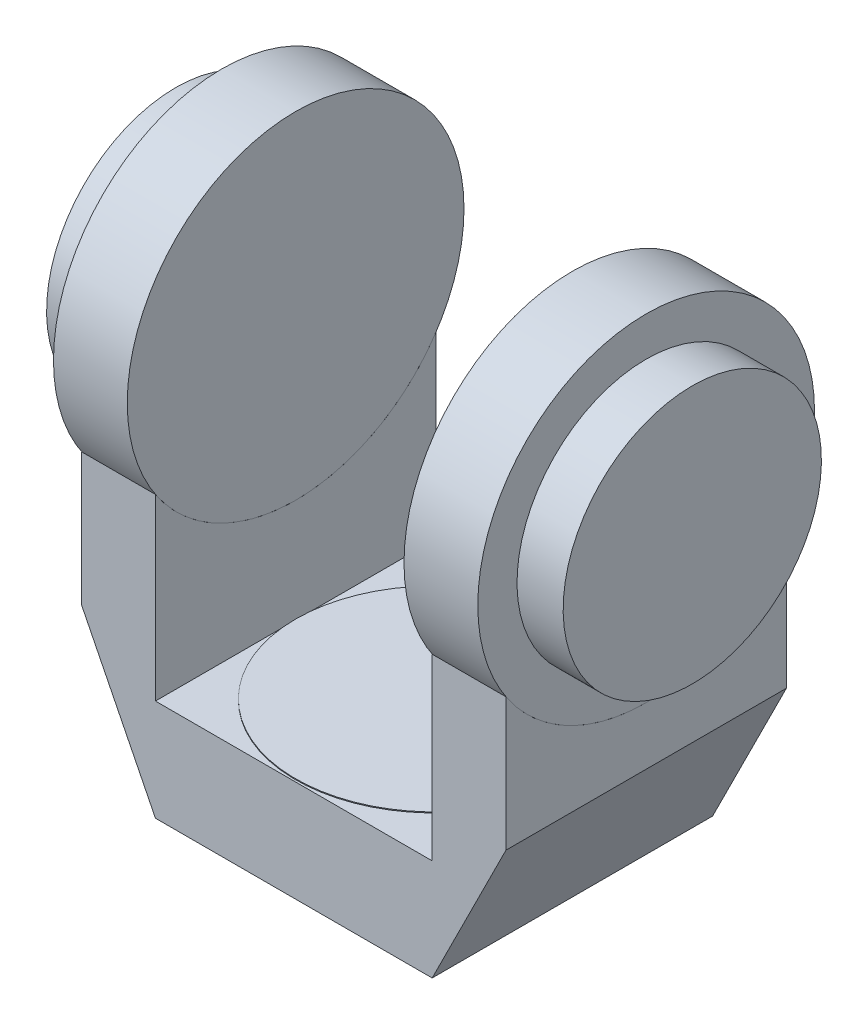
ISO-10303-21;
HEADER;
FILE_DESCRIPTION(('STEP AP214'),'2;1');
FILE_NAME('part.step','',(''),(''),'','','');
FILE_SCHEMA(('AUTOMOTIVE_DESIGN { 1 0 10303 214 1 1 1 1 }'));
ENDSEC;
DATA;
#1=APPLICATION_CONTEXT('core data for automotive mechanical design processes');
#2=APPLICATION_PROTOCOL_DEFINITION('international standard','automotive_design',2000,#1);
#3=PRODUCT_CONTEXT('',#1,'mechanical');
#4=PRODUCT('Part','Part','',(#3));
#5=PRODUCT_RELATED_PRODUCT_CATEGORY('part','',(#4));
#6=PRODUCT_DEFINITION_FORMATION('','',#4);
#7=PRODUCT_DEFINITION_CONTEXT('part definition',#1,'design');
#8=PRODUCT_DEFINITION('design','',#6,#7);
#9=PRODUCT_DEFINITION_SHAPE('','',#8);
#10=(LENGTH_UNIT() NAMED_UNIT(*) SI_UNIT(.MILLI.,.METRE.));
#11=(NAMED_UNIT(*) PLANE_ANGLE_UNIT() SI_UNIT($,.RADIAN.));
#12=(NAMED_UNIT(*) SI_UNIT($,.STERADIAN.) SOLID_ANGLE_UNIT());
#13=UNCERTAINTY_MEASURE_WITH_UNIT(LENGTH_MEASURE(1.E-05),#10,'distance_accuracy_value','');
#14=(GEOMETRIC_REPRESENTATION_CONTEXT(3) GLOBAL_UNCERTAINTY_ASSIGNED_CONTEXT((#13)) GLOBAL_UNIT_ASSIGNED_CONTEXT((#10,
#11,#12)) REPRESENTATION_CONTEXT('',''));
#15=CARTESIAN_POINT('',(0.,0.,0.));
#16=DIRECTION('',(0.,0.,1.));
#17=DIRECTION('',(1.,0.,0.));
#18=AXIS2_PLACEMENT_3D('',#15,#16,#17);
#19=CARTESIAN_POINT('',(0.,55.5,0.));
#20=DIRECTION('',(0.,-1.,0.));
#21=DIRECTION('',(1.,0.,0.));
#22=AXIS2_PLACEMENT_3D('',#19,#20,#21);
#23=CYLINDRICAL_SURFACE('',#22,75.);
#24=CARTESIAN_POINT('',(0.,55.5,0.));
#25=DIRECTION('',(0.,1.,0.));
#26=DIRECTION('',(-1.,0.,0.));
#27=AXIS2_PLACEMENT_3D('',#24,#25,#26);
#28=CIRCLE('',#27,75.);
#29=CARTESIAN_POINT('',(-75.,55.5,0.));
#30=VERTEX_POINT('',#29);
#31=EDGE_CURVE('E11',#30,#30,#28,.T.);
#32=ORIENTED_EDGE('',*,*,#31,.F.);
#33=EDGE_LOOP('',(#32));
#34=FACE_BOUND('',#33,.T.);
#35=CARTESIAN_POINT('',(0.,55.,0.));
#36=DIRECTION('',(0.,1.,0.));
#37=DIRECTION('',(-1.,0.,0.));
#38=AXIS2_PLACEMENT_3D('',#35,#36,#37);
#39=CIRCLE('',#38,75.);
#40=CARTESIAN_POINT('',(-75.,55.,0.));
#41=VERTEX_POINT('',#40);
#42=EDGE_CURVE('E52',#41,#41,#39,.T.);
#43=ORIENTED_EDGE('',*,*,#42,.T.);
#44=EDGE_LOOP('',(#43));
#45=FACE_BOUND('',#44,.T.);
#46=ADVANCED_FACE('F49',(#34,#45),#23,.T.);
#47=CARTESIAN_POINT('',(0.,55.5,0.));
#48=DIRECTION('',(0.,1.,0.));
#49=DIRECTION('',(-1.,0.,0.));
#50=AXIS2_PLACEMENT_3D('',#47,#48,#49);
#51=PLANE('',#50);
#52=ORIENTED_EDGE('',*,*,#31,.T.);
#53=EDGE_LOOP('',(#52));
#54=FACE_BOUND('',#53,.T.);
#55=ADVANCED_FACE('F66',(#54),#51,.T.);
#56=CARTESIAN_POINT('',(0.,55.,0.));
#57=DIRECTION('',(0.,1.,0.));
#58=DIRECTION('',(-1.,0.,0.));
#59=AXIS2_PLACEMENT_3D('',#56,#57,#58);
#60=PLANE('',#59);
#61=ORIENTED_EDGE('',*,*,#42,.F.);
#62=EDGE_LOOP('',(#61));
#63=FACE_BOUND('',#62,.T.);
#64=ADVANCED_FACE('F64',(#63),#60,.F.);
#65=CLOSED_SHELL('',(#46,#55,#64));
#66=MANIFOLD_SOLID_BREP('B2',#65);
#67=CARTESIAN_POINT('',(-373.122259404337,202.513155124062,0.00443107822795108));
#68=DIRECTION('',(1.,0.,0.));
#69=DIRECTION('',(0.,0.,1.));
#70=AXIS2_PLACEMENT_3D('',#67,#68,#69);
#71=CYLINDRICAL_SURFACE('',#70,91.26);
#72=CARTESIAN_POINT('',(-115.,202.513155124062,0.00443107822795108));
#73=DIRECTION('',(-1.,0.,0.));
#74=DIRECTION('',(0.,-1.,0.));
#75=AXIS2_PLACEMENT_3D('',#72,#73,#74);
#76=CIRCLE('',#75,91.26);
#77=CARTESIAN_POINT('',(-115.,111.253155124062,0.00443107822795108));
#78=VERTEX_POINT('',#77);
#79=EDGE_CURVE('E48',#78,#78,#76,.F.);
#80=ORIENTED_EDGE('',*,*,#79,.T.);
#81=EDGE_LOOP('',(#80));
#82=FACE_BOUND('',#81,.T.);
#83=CARTESIAN_POINT('',(-75.,202.513155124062,0.00443107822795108));
#84=DIRECTION('',(-1.,0.,0.));
#85=DIRECTION('',(0.,0.,1.));
#86=AXIS2_PLACEMENT_3D('',#83,#84,#85);
#87=CIRCLE('',#86,91.26);
#88=CARTESIAN_POINT('',(-75.,202.513155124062,91.264431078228));
#89=VERTEX_POINT('',#88);
#90=EDGE_CURVE('E109',#89,#89,#87,.T.);
#91=ORIENTED_EDGE('',*,*,#90,.T.);
#92=EDGE_LOOP('',(#91));
#93=FACE_BOUND('',#92,.T.);
#94=ADVANCED_FACE('F102',(#82,#93),#71,.T.);
#95=CARTESIAN_POINT('',(-75.,202.513155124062,0.00443107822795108));
#96=DIRECTION('',(1.,0.,0.));
#97=DIRECTION('',(0.,0.,1.));
#98=AXIS2_PLACEMENT_3D('',#95,#96,#97);
#99=PLANE('',#98);
#100=ORIENTED_EDGE('',*,*,#90,.F.);
#101=EDGE_LOOP('',(#100));
#102=FACE_BOUND('',#101,.T.);
#103=ADVANCED_FACE('F117',(#102),#99,.T.);
#104=CARTESIAN_POINT('',(-115.,80.,76.));
#105=DIRECTION('',(1.,0.,0.));
#106=DIRECTION('',(0.,-1.,0.));
#107=AXIS2_PLACEMENT_3D('',#104,#105,#106);
#108=PLANE('',#107);
#109=ORIENTED_EDGE('',*,*,#79,.F.);
#110=EDGE_LOOP('',(#109));
#111=FACE_BOUND('',#110,.T.);
#112=ADVANCED_FACE('F119',(#111),#108,.F.);
#113=CLOSED_SHELL('',(#94,#103,#112));
#114=MANIFOLD_SOLID_BREP('B6',#113);
#115=CARTESIAN_POINT('',(-140.,202.513155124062,0.00443107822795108));
#116=DIRECTION('',(1.,0.,0.));
#117=DIRECTION('',(0.,-1.,0.));
#118=AXIS2_PLACEMENT_3D('',#115,#116,#117);
#119=CYLINDRICAL_SURFACE('',#118,70.);
#120=CARTESIAN_POINT('',(-140.,202.513155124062,0.00443107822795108));
#121=DIRECTION('',(1.,0.,0.));
#122=DIRECTION('',(0.,1.,0.));
#123=AXIS2_PLACEMENT_3D('',#120,#121,#122);
#124=CIRCLE('',#123,70.);
#125=CARTESIAN_POINT('',(-140.,272.513155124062,0.00443107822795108));
#126=VERTEX_POINT('',#125);
#127=EDGE_CURVE('E101',#126,#126,#124,.T.);
#128=ORIENTED_EDGE('',*,*,#127,.T.);
#129=EDGE_LOOP('',(#128));
#130=FACE_BOUND('',#129,.T.);
#131=CARTESIAN_POINT('',(-115.,202.513155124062,0.00443107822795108));
#132=DIRECTION('',(1.,0.,0.));
#133=DIRECTION('',(0.,1.,0.));
#134=AXIS2_PLACEMENT_3D('',#131,#132,#133);
#135=CIRCLE('',#134,70.);
#136=CARTESIAN_POINT('',(-115.,272.513155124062,0.00443107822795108));
#137=VERTEX_POINT('',#136);
#138=EDGE_CURVE('E158',#137,#137,#135,.T.);
#139=ORIENTED_EDGE('',*,*,#138,.F.);
#140=EDGE_LOOP('',(#139));
#141=FACE_BOUND('',#140,.T.);
#142=ADVANCED_FACE('F155',(#130,#141),#119,.T.);
#143=CARTESIAN_POINT('',(-140.,202.513155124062,0.00443107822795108));
#144=DIRECTION('',(-1.,0.,0.));
#145=DIRECTION('',(0.,1.,0.));
#146=AXIS2_PLACEMENT_3D('',#143,#144,#145);
#147=PLANE('',#146);
#148=ORIENTED_EDGE('',*,*,#127,.F.);
#149=EDGE_LOOP('',(#148));
#150=FACE_BOUND('',#149,.T.);
#151=ADVANCED_FACE('F172',(#150),#147,.T.);
#152=CARTESIAN_POINT('',(-115.,202.513155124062,0.00443107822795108));
#153=DIRECTION('',(-1.,0.,0.));
#154=DIRECTION('',(0.,1.,0.));
#155=AXIS2_PLACEMENT_3D('',#152,#153,#154);
#156=PLANE('',#155);
#157=ORIENTED_EDGE('',*,*,#138,.T.);
#158=EDGE_LOOP('',(#157));
#159=FACE_BOUND('',#158,.T.);
#160=ADVANCED_FACE('F169',(#159),#156,.F.);
#161=CLOSED_SHELL('',(#142,#151,#160));
#162=MANIFOLD_SOLID_BREP('B43',#161);
#163=CARTESIAN_POINT('',(140.,202.513155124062,0.00443107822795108));
#164=DIRECTION('',(-1.,0.,0.));
#165=DIRECTION('',(0.,-1.,0.));
#166=AXIS2_PLACEMENT_3D('',#163,#164,#165);
#167=CYLINDRICAL_SURFACE('',#166,70.);
#168=CARTESIAN_POINT('',(140.,202.513155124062,0.00443107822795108));
#169=DIRECTION('',(1.,0.,0.));
#170=DIRECTION('',(0.,1.,0.));
#171=AXIS2_PLACEMENT_3D('',#168,#169,#170);
#172=CIRCLE('',#171,70.);
#173=CARTESIAN_POINT('',(140.,272.513155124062,0.00443107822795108));
#174=VERTEX_POINT('',#173);
#175=EDGE_CURVE('E154',#174,#174,#172,.T.);
#176=ORIENTED_EDGE('',*,*,#175,.F.);
#177=EDGE_LOOP('',(#176));
#178=FACE_BOUND('',#177,.T.);
#179=CARTESIAN_POINT('',(115.,202.513155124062,0.00443107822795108));
#180=DIRECTION('',(1.,0.,0.));
#181=DIRECTION('',(0.,1.,0.));
#182=AXIS2_PLACEMENT_3D('',#179,#180,#181);
#183=CIRCLE('',#182,70.);
#184=CARTESIAN_POINT('',(115.,272.513155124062,0.00443107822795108));
#185=VERTEX_POINT('',#184);
#186=EDGE_CURVE('E211',#185,#185,#183,.T.);
#187=ORIENTED_EDGE('',*,*,#186,.T.);
#188=EDGE_LOOP('',(#187));
#189=FACE_BOUND('',#188,.T.);
#190=ADVANCED_FACE('F208',(#178,#189),#167,.T.);
#191=CARTESIAN_POINT('',(140.,202.513155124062,0.00443107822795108));
#192=DIRECTION('',(1.,0.,0.));
#193=DIRECTION('',(0.,1.,0.));
#194=AXIS2_PLACEMENT_3D('',#191,#192,#193);
#195=PLANE('',#194);
#196=ORIENTED_EDGE('',*,*,#175,.T.);
#197=EDGE_LOOP('',(#196));
#198=FACE_BOUND('',#197,.T.);
#199=ADVANCED_FACE('F225',(#198),#195,.T.);
#200=CARTESIAN_POINT('',(115.,202.513155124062,0.00443107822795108));
#201=DIRECTION('',(1.,0.,0.));
#202=DIRECTION('',(0.,1.,0.));
#203=AXIS2_PLACEMENT_3D('',#200,#201,#202);
#204=PLANE('',#203);
#205=ORIENTED_EDGE('',*,*,#186,.F.);
#206=EDGE_LOOP('',(#205));
#207=FACE_BOUND('',#206,.T.);
#208=ADVANCED_FACE('F223',(#207),#204,.F.);
#209=CLOSED_SHELL('',(#190,#199,#208));
#210=MANIFOLD_SOLID_BREP('B96',#209);
#211=CARTESIAN_POINT('',(373.122259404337,202.513155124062,0.00443107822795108));
#212=DIRECTION('',(-1.,0.,0.));
#213=DIRECTION('',(0.,0.,1.));
#214=AXIS2_PLACEMENT_3D('',#211,#212,#213);
#215=CYLINDRICAL_SURFACE('',#214,91.26);
#216=CARTESIAN_POINT('',(115.,202.513155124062,0.00443107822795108));
#217=DIRECTION('',(-1.,0.,0.));
#218=DIRECTION('',(0.,-1.,0.));
#219=AXIS2_PLACEMENT_3D('',#216,#217,#218);
#220=CIRCLE('',#219,91.26);
#221=CARTESIAN_POINT('',(115.,111.253155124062,0.00443107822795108));
#222=VERTEX_POINT('',#221);
#223=EDGE_CURVE('E207',#222,#222,#220,.F.);
#224=ORIENTED_EDGE('',*,*,#223,.F.);
#225=EDGE_LOOP('',(#224));
#226=FACE_BOUND('',#225,.T.);
#227=CARTESIAN_POINT('',(75.,202.513155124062,0.00443107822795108));
#228=DIRECTION('',(-1.,0.,0.));
#229=DIRECTION('',(0.,0.,1.));
#230=AXIS2_PLACEMENT_3D('',#227,#228,#229);
#231=CIRCLE('',#230,91.26);
#232=CARTESIAN_POINT('',(75.,202.513155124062,91.264431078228));
#233=VERTEX_POINT('',#232);
#234=EDGE_CURVE('E269',#233,#233,#231,.T.);
#235=ORIENTED_EDGE('',*,*,#234,.F.);
#236=EDGE_LOOP('',(#235));
#237=FACE_BOUND('',#236,.T.);
#238=ADVANCED_FACE('F262',(#226,#237),#215,.T.);
#239=CARTESIAN_POINT('',(75.,202.513155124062,0.00443107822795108));
#240=DIRECTION('',(-1.,0.,0.));
#241=DIRECTION('',(0.,0.,1.));
#242=AXIS2_PLACEMENT_3D('',#239,#240,#241);
#243=PLANE('',#242);
#244=ORIENTED_EDGE('',*,*,#234,.T.);
#245=EDGE_LOOP('',(#244));
#246=FACE_BOUND('',#245,.T.);
#247=ADVANCED_FACE('F276',(#246),#243,.T.);
#248=CARTESIAN_POINT('',(115.,80.,76.));
#249=DIRECTION('',(-1.,0.,0.));
#250=DIRECTION('',(0.,-1.,0.));
#251=AXIS2_PLACEMENT_3D('',#248,#249,#250);
#252=PLANE('',#251);
#253=ORIENTED_EDGE('',*,*,#223,.T.);
#254=EDGE_LOOP('',(#253));
#255=FACE_BOUND('',#254,.T.);
#256=ADVANCED_FACE('F283',(#255),#252,.F.);
#257=CLOSED_SHELL('',(#238,#247,#256));
#258=MANIFOLD_SOLID_BREP('B149',#257);
#259=CARTESIAN_POINT('',(-75.,0.,76.));
#260=DIRECTION('',(0.894427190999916,0.447213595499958,0.));
#261=DIRECTION('',(-0.447213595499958,0.894427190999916,0.));
#262=AXIS2_PLACEMENT_3D('',#259,#260,#261);
#263=PLANE('',#262);
#264=DIRECTION('',(0.447213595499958,-0.894427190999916,0.));
#265=VECTOR('',#264,1.);
#266=CARTESIAN_POINT('',(-75.,0.,-76.));
#267=LINE('',#266,#265);
#268=CARTESIAN_POINT('',(-115.,80.,-76.));
#269=VERTEX_POINT('',#268);
#270=CARTESIAN_POINT('',(-75.,0.,-76.));
#271=VERTEX_POINT('',#270);
#272=EDGE_CURVE('E423',#269,#271,#267,.T.);
#273=ORIENTED_EDGE('',*,*,#272,.T.);
#274=DIRECTION('',(0.,0.,-1.));
#275=VECTOR('',#274,1.);
#276=CARTESIAN_POINT('',(-75.,0.,76.));
#277=LINE('',#276,#275);
#278=CARTESIAN_POINT('',(-75.,0.,76.));
#279=VERTEX_POINT('',#278);
#280=EDGE_CURVE('E260',#279,#271,#277,.T.);
#281=ORIENTED_EDGE('',*,*,#280,.F.);
#282=DIRECTION('',(0.447213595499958,-0.894427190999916,0.));
#283=VECTOR('',#282,1.);
#284=CARTESIAN_POINT('',(-75.,0.,76.));
#285=LINE('',#284,#283);
#286=CARTESIAN_POINT('',(-115.,80.,76.));
#287=VERTEX_POINT('',#286);
#288=EDGE_CURVE('E455',#287,#279,#285,.T.);
#289=ORIENTED_EDGE('',*,*,#288,.F.);
#290=DIRECTION('',(0.,0.,-1.));
#291=VECTOR('',#290,1.);
#292=CARTESIAN_POINT('',(-115.,80.,76.));
#293=LINE('',#292,#291);
#294=EDGE_CURVE('E422',#287,#269,#293,.T.);
#295=ORIENTED_EDGE('',*,*,#294,.T.);
#296=EDGE_LOOP('',(#273,#281,#289,#295));
#297=FACE_BOUND('',#296,.T.);
#298=ADVANCED_FACE('F307',(#297),#263,.F.);
#299=CARTESIAN_POINT('',(75.,0.,76.));
#300=DIRECTION('',(0.,1.,0.));
#301=DIRECTION('',(-1.,0.,0.));
#302=AXIS2_PLACEMENT_3D('',#299,#300,#301);
#303=PLANE('',#302);
#304=DIRECTION('',(1.,0.,0.));
#305=VECTOR('',#304,1.);
#306=CARTESIAN_POINT('',(75.,0.,-76.));
#307=LINE('',#306,#305);
#308=CARTESIAN_POINT('',(75.,0.,-76.));
#309=VERTEX_POINT('',#308);
#310=EDGE_CURVE('E427',#271,#309,#307,.T.);
#311=ORIENTED_EDGE('',*,*,#310,.T.);
#312=DIRECTION('',(0.,0.,-1.));
#313=VECTOR('',#312,1.);
#314=CARTESIAN_POINT('',(75.,0.,76.));
#315=LINE('',#314,#313);
#316=CARTESIAN_POINT('',(75.,0.,76.));
#317=VERTEX_POINT('',#316);
#318=EDGE_CURVE('E316',#317,#309,#315,.T.);
#319=ORIENTED_EDGE('',*,*,#318,.F.);
#320=DIRECTION('',(1.,0.,0.));
#321=VECTOR('',#320,1.);
#322=CARTESIAN_POINT('',(75.,0.,76.));
#323=LINE('',#322,#321);
#324=EDGE_CURVE('E370',#279,#317,#323,.T.);
#325=ORIENTED_EDGE('',*,*,#324,.F.);
#326=ORIENTED_EDGE('',*,*,#280,.T.);
#327=EDGE_LOOP('',(#311,#319,#325,#326));
#328=FACE_BOUND('',#327,.T.);
#329=ADVANCED_FACE('F510',(#328),#303,.F.);
#330=CARTESIAN_POINT('',(75.,0.,76.));
#331=DIRECTION('',(-0.894427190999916,0.447213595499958,0.));
#332=DIRECTION('',(-0.447213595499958,-0.894427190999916,0.));
#333=AXIS2_PLACEMENT_3D('',#330,#331,#332);
#334=PLANE('',#333);
#335=DIRECTION('',(0.447213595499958,0.894427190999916,0.));
#336=VECTOR('',#335,1.);
#337=CARTESIAN_POINT('',(75.,0.,-76.));
#338=LINE('',#337,#336);
#339=CARTESIAN_POINT('',(115.,80.,-76.));
#340=VERTEX_POINT('',#339);
#341=EDGE_CURVE('E431',#309,#340,#338,.T.);
#342=ORIENTED_EDGE('',*,*,#341,.T.);
#343=DIRECTION('',(0.,0.,-1.));
#344=VECTOR('',#343,1.);
#345=CARTESIAN_POINT('',(115.,80.,76.));
#346=LINE('',#345,#344);
#347=CARTESIAN_POINT('',(115.,80.,76.));
#348=VERTEX_POINT('',#347);
#349=EDGE_CURVE('E403',#348,#340,#346,.T.);
#350=ORIENTED_EDGE('',*,*,#349,.F.);
#351=DIRECTION('',(0.447213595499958,0.894427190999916,0.));
#352=VECTOR('',#351,1.);
#353=CARTESIAN_POINT('',(75.,0.,76.));
#354=LINE('',#353,#352);
#355=EDGE_CURVE('E471',#317,#348,#354,.T.);
#356=ORIENTED_EDGE('',*,*,#355,.F.);
#357=ORIENTED_EDGE('',*,*,#318,.T.);
#358=EDGE_LOOP('',(#342,#350,#356,#357));
#359=FACE_BOUND('',#358,.T.);
#360=ADVANCED_FACE('F469',(#359),#334,.F.);
#361=CARTESIAN_POINT('',(115.,80.,76.));
#362=DIRECTION('',(-1.,0.,0.));
#363=DIRECTION('',(0.,-1.,0.));
#364=AXIS2_PLACEMENT_3D('',#361,#362,#363);
#365=PLANE('',#364);
#366=DIRECTION('',(0.,1.,0.));
#367=VECTOR('',#366,1.);
#368=CARTESIAN_POINT('',(115.,80.,-76.));
#369=LINE('',#368,#367);
#370=CARTESIAN_POINT('',(115.,152.,-76.));
#371=VERTEX_POINT('',#370);
#372=EDGE_CURVE('E434',#340,#371,#369,.T.);
#373=ORIENTED_EDGE('',*,*,#372,.T.);
#374=CARTESIAN_POINT('',(115.,202.513155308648,0.));
#375=DIRECTION('',(1.,0.,0.));
#376=DIRECTION('',(0.,1.,0.));
#377=AXIS2_PLACEMENT_3D('',#374,#375,#376);
#378=CIRCLE('',#377,91.2555689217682);
#379=CARTESIAN_POINT('',(115.,152.,76.));
#380=VERTEX_POINT('',#379);
#381=EDGE_CURVE('E482',#380,#371,#378,.T.);
#382=ORIENTED_EDGE('',*,*,#381,.F.);
#383=DIRECTION('',(0.,1.,0.));
#384=VECTOR('',#383,1.);
#385=CARTESIAN_POINT('',(115.,80.,76.));
#386=LINE('',#385,#384);
#387=EDGE_CURVE('E483',#348,#380,#386,.T.);
#388=ORIENTED_EDGE('',*,*,#387,.F.);
#389=ORIENTED_EDGE('',*,*,#349,.T.);
#390=EDGE_LOOP('',(#373,#382,#388,#389));
#391=FACE_BOUND('',#390,.T.);
#392=ADVANCED_FACE('F479',(#391),#365,.F.);
#393=CARTESIAN_POINT('',(75.,152.,76.));
#394=DIRECTION('',(1.,0.,0.));
#395=DIRECTION('',(0.,0.,-1.));
#396=AXIS2_PLACEMENT_3D('',#393,#394,#395);
#397=PLANE('',#396);
#398=DIRECTION('',(0.,-1.,0.));
#399=VECTOR('',#398,1.);
#400=CARTESIAN_POINT('',(75.,152.,76.));
#401=LINE('',#400,#399);
#402=CARTESIAN_POINT('',(74.9999999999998,152.,76.));
#403=VERTEX_POINT('',#402);
#404=CARTESIAN_POINT('',(75.,55.,76.));
#405=VERTEX_POINT('',#404);
#406=EDGE_CURVE('E380',#403,#405,#401,.T.);
#407=ORIENTED_EDGE('',*,*,#406,.F.);
#408=CARTESIAN_POINT('',(75.,202.513155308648,0.));
#409=DIRECTION('',(1.,0.,0.));
#410=DIRECTION('',(0.,0.,-1.));
#411=AXIS2_PLACEMENT_3D('',#408,#409,#410);
#412=CIRCLE('',#411,91.2555689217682);
#413=CARTESIAN_POINT('',(74.9999999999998,152.,-76.));
#414=VERTEX_POINT('',#413);
#415=EDGE_CURVE('E428',#403,#414,#412,.T.);
#416=ORIENTED_EDGE('',*,*,#415,.T.);
#417=DIRECTION('',(0.,-1.,0.));
#418=VECTOR('',#417,1.);
#419=CARTESIAN_POINT('',(75.,152.,-76.));
#420=LINE('',#419,#418);
#421=CARTESIAN_POINT('',(75.,55.,-76.));
#422=VERTEX_POINT('',#421);
#423=EDGE_CURVE('E399',#414,#422,#420,.T.);
#424=ORIENTED_EDGE('',*,*,#423,.T.);
#425=DIRECTION('',(0.,0.,-1.));
#426=VECTOR('',#425,1.);
#427=CARTESIAN_POINT('',(75.,55.,76.));
#428=LINE('',#427,#426);
#429=EDGE_CURVE('E396',#405,#422,#428,.T.);
#430=ORIENTED_EDGE('',*,*,#429,.F.);
#431=EDGE_LOOP('',(#407,#416,#424,#430));
#432=FACE_BOUND('',#431,.T.);
#433=ADVANCED_FACE('F397',(#432),#397,.F.);
#434=CARTESIAN_POINT('',(-75.,55.,76.));
#435=DIRECTION('',(0.,-1.,0.));
#436=DIRECTION('',(1.,0.,0.));
#437=AXIS2_PLACEMENT_3D('',#434,#435,#436);
#438=PLANE('',#437);
#439=DIRECTION('',(-1.,0.,0.));
#440=VECTOR('',#439,1.);
#441=CARTESIAN_POINT('',(-75.,55.,-76.));
#442=LINE('',#441,#440);
#443=CARTESIAN_POINT('',(-75.,55.,-76.));
#444=VERTEX_POINT('',#443);
#445=EDGE_CURVE('E444',#422,#444,#442,.T.);
#446=ORIENTED_EDGE('',*,*,#445,.T.);
#447=DIRECTION('',(0.,0.,-1.));
#448=VECTOR('',#447,1.);
#449=CARTESIAN_POINT('',(-75.,55.,76.));
#450=LINE('',#449,#448);
#451=CARTESIAN_POINT('',(-75.,55.,76.));
#452=VERTEX_POINT('',#451);
#453=EDGE_CURVE('E404',#452,#444,#450,.T.);
#454=ORIENTED_EDGE('',*,*,#453,.F.);
#455=DIRECTION('',(-1.,0.,0.));
#456=VECTOR('',#455,1.);
#457=CARTESIAN_POINT('',(-75.,55.,76.));
#458=LINE('',#457,#456);
#459=EDGE_CURVE('E385',#405,#452,#458,.T.);
#460=ORIENTED_EDGE('',*,*,#459,.F.);
#461=ORIENTED_EDGE('',*,*,#429,.T.);
#462=EDGE_LOOP('',(#446,#454,#460,#461));
#463=FACE_BOUND('',#462,.T.);
#464=ADVANCED_FACE('F406',(#463),#438,.F.);
#465=CARTESIAN_POINT('',(-75.,152.,76.));
#466=DIRECTION('',(-1.,0.,0.));
#467=DIRECTION('',(0.,0.,1.));
#468=AXIS2_PLACEMENT_3D('',#465,#466,#467);
#469=PLANE('',#468);
#470=DIRECTION('',(0.,1.,0.));
#471=VECTOR('',#470,1.);
#472=CARTESIAN_POINT('',(-75.,152.,-76.));
#473=LINE('',#472,#471);
#474=CARTESIAN_POINT('',(-75.,152.,-76.));
#475=VERTEX_POINT('',#474);
#476=EDGE_CURVE('E447',#444,#475,#473,.T.);
#477=ORIENTED_EDGE('',*,*,#476,.T.);
#478=CARTESIAN_POINT('',(-75.,202.513155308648,0.));
#479=DIRECTION('',(-1.,0.,0.));
#480=DIRECTION('',(0.,0.,1.));
#481=AXIS2_PLACEMENT_3D('',#478,#479,#480);
#482=CIRCLE('',#481,91.2555689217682);
#483=CARTESIAN_POINT('',(-75.,152.,76.));
#484=VERTEX_POINT('',#483);
#485=EDGE_CURVE('E355',#475,#484,#482,.T.);
#486=ORIENTED_EDGE('',*,*,#485,.T.);
#487=DIRECTION('',(0.,1.,0.));
#488=VECTOR('',#487,1.);
#489=CARTESIAN_POINT('',(-75.,152.,76.));
#490=LINE('',#489,#488);
#491=EDGE_CURVE('E410',#452,#484,#490,.T.);
#492=ORIENTED_EDGE('',*,*,#491,.F.);
#493=ORIENTED_EDGE('',*,*,#453,.T.);
#494=EDGE_LOOP('',(#477,#486,#492,#493));
#495=FACE_BOUND('',#494,.T.);
#496=ADVANCED_FACE('F524',(#495),#469,.F.);
#497=CARTESIAN_POINT('',(-115.,80.,76.));
#498=DIRECTION('',(1.,0.,0.));
#499=DIRECTION('',(0.,1.,0.));
#500=AXIS2_PLACEMENT_3D('',#497,#498,#499);
#501=PLANE('',#500);
#502=DIRECTION('',(0.,-1.,0.));
#503=VECTOR('',#502,1.);
#504=CARTESIAN_POINT('',(-115.,80.,76.));
#505=LINE('',#504,#503);
#506=CARTESIAN_POINT('',(-115.,152.,76.));
#507=VERTEX_POINT('',#506);
#508=EDGE_CURVE('E324',#507,#287,#505,.T.);
#509=ORIENTED_EDGE('',*,*,#508,.F.);
#510=CARTESIAN_POINT('',(-115.,202.513155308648,0.));
#511=DIRECTION('',(1.,0.,0.));
#512=DIRECTION('',(0.,1.,0.));
#513=AXIS2_PLACEMENT_3D('',#510,#511,#512);
#514=CIRCLE('',#513,91.2555689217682);
#515=CARTESIAN_POINT('',(-115.,152.,-76.));
#516=VERTEX_POINT('',#515);
#517=EDGE_CURVE('E496',#516,#507,#514,.F.);
#518=ORIENTED_EDGE('',*,*,#517,.F.);
#519=DIRECTION('',(0.,-1.,0.));
#520=VECTOR('',#519,1.);
#521=CARTESIAN_POINT('',(-115.,80.,-76.));
#522=LINE('',#521,#520);
#523=EDGE_CURVE('E362',#516,#269,#522,.T.);
#524=ORIENTED_EDGE('',*,*,#523,.T.);
#525=ORIENTED_EDGE('',*,*,#294,.F.);
#526=EDGE_LOOP('',(#509,#518,#524,#525));
#527=FACE_BOUND('',#526,.T.);
#528=ADVANCED_FACE('F506',(#527),#501,.F.);
#529=CARTESIAN_POINT('',(0.,0.,76.));
#530=DIRECTION('',(0.,0.,-1.));
#531=DIRECTION('',(-1.,0.,0.));
#532=AXIS2_PLACEMENT_3D('',#529,#530,#531);
#533=PLANE('',#532);
#534=ORIENTED_EDGE('',*,*,#288,.T.);
#535=ORIENTED_EDGE('',*,*,#324,.T.);
#536=ORIENTED_EDGE('',*,*,#355,.T.);
#537=ORIENTED_EDGE('',*,*,#387,.T.);
#538=DIRECTION('',(-1.,0.,0.));
#539=VECTOR('',#538,1.);
#540=CARTESIAN_POINT('',(115.,152.,76.));
#541=LINE('',#540,#539);
#542=EDGE_CURVE('E390',#380,#403,#541,.T.);
#543=ORIENTED_EDGE('',*,*,#542,.T.);
#544=ORIENTED_EDGE('',*,*,#406,.T.);
#545=ORIENTED_EDGE('',*,*,#459,.T.);
#546=ORIENTED_EDGE('',*,*,#491,.T.);
#547=DIRECTION('',(-1.,0.,0.));
#548=VECTOR('',#547,1.);
#549=CARTESIAN_POINT('',(-115.,152.,76.));
#550=LINE('',#549,#548);
#551=EDGE_CURVE('E414',#484,#507,#550,.T.);
#552=ORIENTED_EDGE('',*,*,#551,.T.);
#553=ORIENTED_EDGE('',*,*,#508,.T.);
#554=EDGE_LOOP('',(#534,#535,#536,#537,#543,#544,#545,#546,#552,#553));
#555=FACE_BOUND('',#554,.T.);
#556=ADVANCED_FACE('F382',(#555),#533,.F.);
#557=CARTESIAN_POINT('',(0.,0.,-76.));
#558=DIRECTION('',(0.,0.,-1.));
#559=DIRECTION('',(-1.,0.,0.));
#560=AXIS2_PLACEMENT_3D('',#557,#558,#559);
#561=PLANE('',#560);
#562=ORIENTED_EDGE('',*,*,#272,.F.);
#563=ORIENTED_EDGE('',*,*,#523,.F.);
#564=DIRECTION('',(-1.,0.,0.));
#565=VECTOR('',#564,1.);
#566=CARTESIAN_POINT('',(-115.,152.,-76.));
#567=LINE('',#566,#565);
#568=EDGE_CURVE('E450',#475,#516,#567,.T.);
#569=ORIENTED_EDGE('',*,*,#568,.F.);
#570=ORIENTED_EDGE('',*,*,#476,.F.);
#571=ORIENTED_EDGE('',*,*,#445,.F.);
#572=ORIENTED_EDGE('',*,*,#423,.F.);
#573=DIRECTION('',(-1.,0.,0.));
#574=VECTOR('',#573,1.);
#575=CARTESIAN_POINT('',(115.,152.,-76.));
#576=LINE('',#575,#574);
#577=EDGE_CURVE('E438',#371,#414,#576,.T.);
#578=ORIENTED_EDGE('',*,*,#577,.F.);
#579=ORIENTED_EDGE('',*,*,#372,.F.);
#580=ORIENTED_EDGE('',*,*,#341,.F.);
#581=ORIENTED_EDGE('',*,*,#310,.F.);
#582=EDGE_LOOP('',(#562,#563,#569,#570,#571,#572,#578,#579,#580,#581));
#583=FACE_BOUND('',#582,.T.);
#584=ADVANCED_FACE('F475',(#583),#561,.T.);
#585=CARTESIAN_POINT('',(-272.365638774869,202.513155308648,0.));
#586=DIRECTION('',(1.,0.,0.));
#587=DIRECTION('',(0.,1.,0.));
#588=AXIS2_PLACEMENT_3D('',#585,#586,#587);
#589=CYLINDRICAL_SURFACE('',#588,91.2555689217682);
#590=ORIENTED_EDGE('',*,*,#542,.F.);
#591=ORIENTED_EDGE('',*,*,#381,.T.);
#592=ORIENTED_EDGE('',*,*,#577,.T.);
#593=ORIENTED_EDGE('',*,*,#415,.F.);
#594=EDGE_LOOP('',(#590,#591,#592,#593));
#595=FACE_BOUND('',#594,.T.);
#596=ADVANCED_FACE('F532',(#595),#589,.F.);
#597=ORIENTED_EDGE('',*,*,#568,.T.);
#598=ORIENTED_EDGE('',*,*,#517,.T.);
#599=ORIENTED_EDGE('',*,*,#551,.F.);
#600=ORIENTED_EDGE('',*,*,#485,.F.);
#601=EDGE_LOOP('',(#597,#598,#599,#600));
#602=FACE_BOUND('',#601,.T.);
#603=ADVANCED_FACE('F501',(#602),#589,.F.);
#604=CLOSED_SHELL('',(#298,#329,#360,#392,#433,#464,#496,#528,#556,#584,#596,#603));
#605=MANIFOLD_SOLID_BREP('B202',#604);
#606=ADVANCED_BREP_SHAPE_REPRESENTATION('',(#18,#66,#114,#162,#210,#258,#605),#14);
#607=SHAPE_DEFINITION_REPRESENTATION(#9,#606);
ENDSEC;
END-ISO-10303-21;
